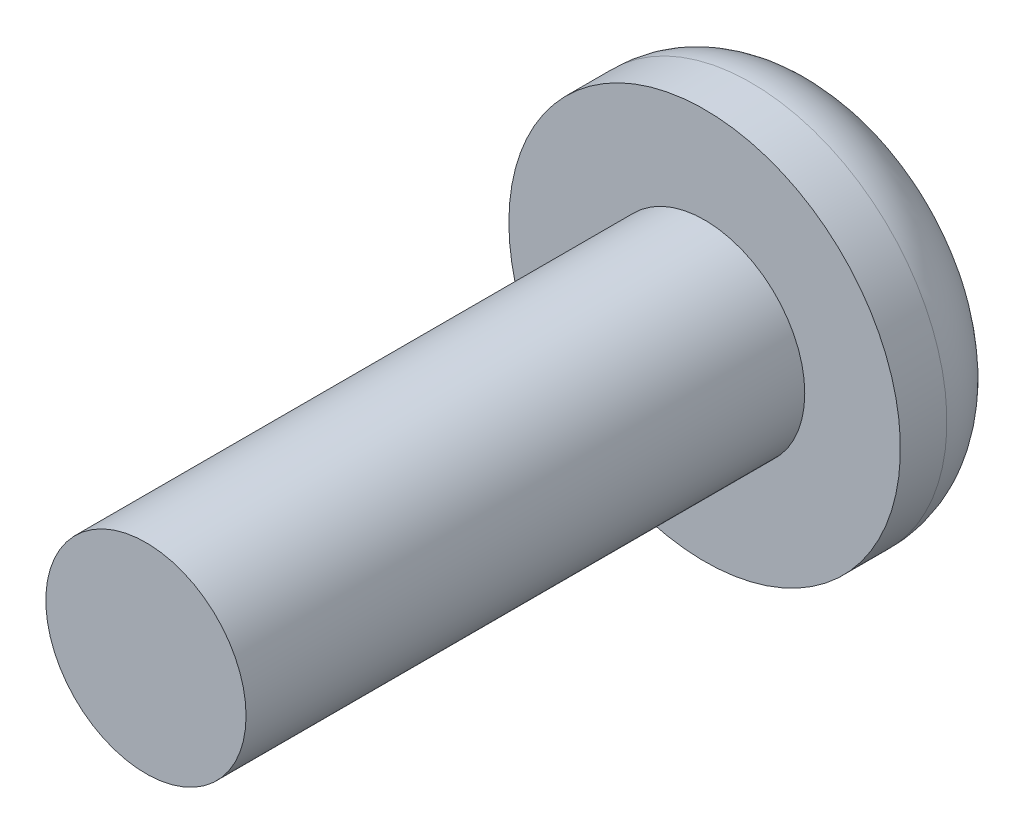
ISO-10303-21;
HEADER;
FILE_DESCRIPTION(('STEP AP214'),'2;1');
FILE_NAME('part.step','',(''),(''),'','','');
FILE_SCHEMA(('AUTOMOTIVE_DESIGN { 1 0 10303 214 1 1 1 1 }'));
ENDSEC;
DATA;
#1=APPLICATION_CONTEXT('core data for automotive mechanical design processes');
#2=APPLICATION_PROTOCOL_DEFINITION('international standard','automotive_design',2000,#1);
#3=PRODUCT_CONTEXT('',#1,'mechanical');
#4=PRODUCT('Part','Part','',(#3));
#5=PRODUCT_RELATED_PRODUCT_CATEGORY('part','',(#4));
#6=PRODUCT_DEFINITION_FORMATION('','',#4);
#7=PRODUCT_DEFINITION_CONTEXT('part definition',#1,'design');
#8=PRODUCT_DEFINITION('design','',#6,#7);
#9=PRODUCT_DEFINITION_SHAPE('','',#8);
#10=(LENGTH_UNIT() NAMED_UNIT(*) SI_UNIT(.MILLI.,.METRE.));
#11=(NAMED_UNIT(*) PLANE_ANGLE_UNIT() SI_UNIT($,.RADIAN.));
#12=(NAMED_UNIT(*) SI_UNIT($,.STERADIAN.) SOLID_ANGLE_UNIT());
#13=UNCERTAINTY_MEASURE_WITH_UNIT(LENGTH_MEASURE(1.E-05),#10,'distance_accuracy_value','');
#14=(GEOMETRIC_REPRESENTATION_CONTEXT(3) GLOBAL_UNCERTAINTY_ASSIGNED_CONTEXT((#13)) GLOBAL_UNIT_ASSIGNED_CONTEXT((#10,
#11,#12)) REPRESENTATION_CONTEXT('',''));
#15=CARTESIAN_POINT('',(0.,0.,0.));
#16=DIRECTION('',(0.,0.,1.));
#17=DIRECTION('',(1.,0.,0.));
#18=AXIS2_PLACEMENT_3D('',#15,#16,#17);
#19=CARTESIAN_POINT('',(0.,0.,-1.7272));
#20=DIRECTION('',(0.,0.,-1.));
#21=DIRECTION('',(-1.,0.,0.));
#22=AXIS2_PLACEMENT_3D('',#19,#20,#21);
#23=PLANE('',#22);
#24=CARTESIAN_POINT('',(0.,0.,-1.7272));
#25=DIRECTION('',(0.,0.,-1.));
#26=DIRECTION('',(-1.,0.,0.));
#27=AXIS2_PLACEMENT_3D('',#24,#25,#26);
#28=CIRCLE('',#27,1.7145);
#29=CARTESIAN_POINT('',(-1.7145,0.,-1.7272));
#30=VERTEX_POINT('',#29);
#31=EDGE_CURVE('E45',#30,#30,#28,.T.);
#32=ORIENTED_EDGE('',*,*,#31,.T.);
#33=EDGE_LOOP('',(#32));
#34=FACE_BOUND('',#33,.T.);
#35=DIRECTION('',(0.,-1.,0.));
#36=VECTOR('',#35,1.);
#37=CARTESIAN_POINT('',(1.4224,0.342899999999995,-1.72719999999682));
#38=LINE('',#37,#36);
#39=CARTESIAN_POINT('',(1.4224,0.342899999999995,-1.72719999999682));
#40=VERTEX_POINT('',#39);
#41=CARTESIAN_POINT('',(1.4224,-0.342900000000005,-1.72719999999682));
#42=VERTEX_POINT('',#41);
#43=EDGE_CURVE('E196',#40,#42,#38,.T.);
#44=ORIENTED_EDGE('',*,*,#43,.F.);
#45=DIRECTION('',(-1.,0.,0.));
#46=VECTOR('',#45,1.);
#47=CARTESIAN_POINT('',(1.4224,0.342899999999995,-1.72719999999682));
#48=LINE('',#47,#46);
#49=CARTESIAN_POINT('',(0.3429,0.342899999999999,-1.72719999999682));
#50=VERTEX_POINT('',#49);
#51=EDGE_CURVE('E190',#40,#50,#48,.T.);
#52=ORIENTED_EDGE('',*,*,#51,.T.);
#53=DIRECTION('',(0.,1.,0.));
#54=VECTOR('',#53,1.);
#55=CARTESIAN_POINT('',(0.3429,0.,-1.72719999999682));
#56=LINE('',#55,#54);
#57=CARTESIAN_POINT('',(0.3429,1.4224,-1.72719999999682));
#58=VERTEX_POINT('',#57);
#59=EDGE_CURVE('E65',#50,#58,#56,.T.);
#60=ORIENTED_EDGE('',*,*,#59,.T.);
#61=DIRECTION('',(1.,0.,0.));
#62=VECTOR('',#61,1.);
#63=CARTESIAN_POINT('',(-0.3429,1.4224,-1.72719999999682));
#64=LINE('',#63,#62);
#65=CARTESIAN_POINT('',(-0.3429,1.4224,-1.72719999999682));
#66=VERTEX_POINT('',#65);
#67=EDGE_CURVE('E217',#66,#58,#64,.T.);
#68=ORIENTED_EDGE('',*,*,#67,.F.);
#69=DIRECTION('',(0.,-1.,0.));
#70=VECTOR('',#69,1.);
#71=CARTESIAN_POINT('',(-0.3429,1.4224,-1.72719999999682));
#72=LINE('',#71,#70);
#73=CARTESIAN_POINT('',(-0.3429,0.342900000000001,-1.72719999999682));
#74=VERTEX_POINT('',#73);
#75=EDGE_CURVE('E211',#66,#74,#72,.T.);
#76=ORIENTED_EDGE('',*,*,#75,.T.);
#77=CARTESIAN_POINT('',(-1.4224,0.342900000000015,-1.72719999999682));
#78=VERTEX_POINT('',#77);
#79=EDGE_CURVE('E199',#74,#78,#48,.T.);
#80=ORIENTED_EDGE('',*,*,#79,.T.);
#81=DIRECTION('',(0.,1.,0.));
#82=VECTOR('',#81,1.);
#83=CARTESIAN_POINT('',(-1.4224,-0.342899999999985,-1.72719999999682));
#84=LINE('',#83,#82);
#85=CARTESIAN_POINT('',(-1.4224,-0.342899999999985,-1.72719999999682));
#86=VERTEX_POINT('',#85);
#87=EDGE_CURVE('E144',#86,#78,#84,.T.);
#88=ORIENTED_EDGE('',*,*,#87,.F.);
#89=DIRECTION('',(1.,0.,0.));
#90=VECTOR('',#89,1.);
#91=CARTESIAN_POINT('',(-1.4224,-0.342899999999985,-1.72719999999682));
#92=LINE('',#91,#90);
#93=CARTESIAN_POINT('',(-0.34290000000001,-0.342899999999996,-1.72719999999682));
#94=VERTEX_POINT('',#93);
#95=EDGE_CURVE('E155',#86,#94,#92,.T.);
#96=ORIENTED_EDGE('',*,*,#95,.T.);
#97=DIRECTION('',(0.,-1.,0.));
#98=VECTOR('',#97,1.);
#99=CARTESIAN_POINT('',(-0.3429,0.,-1.72719999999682));
#100=LINE('',#99,#98);
#101=CARTESIAN_POINT('',(-0.34290000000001,-1.4224,-1.72719999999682));
#102=VERTEX_POINT('',#101);
#103=EDGE_CURVE('E164',#94,#102,#100,.T.);
#104=ORIENTED_EDGE('',*,*,#103,.T.);
#105=DIRECTION('',(-1.,0.,0.));
#106=VECTOR('',#105,1.);
#107=CARTESIAN_POINT('',(0.34289999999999,-1.4224,-1.72719999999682));
#108=LINE('',#107,#106);
#109=CARTESIAN_POINT('',(0.34289999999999,-1.4224,-1.72719999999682));
#110=VERTEX_POINT('',#109);
#111=EDGE_CURVE('E177',#110,#102,#108,.T.);
#112=ORIENTED_EDGE('',*,*,#111,.F.);
#113=DIRECTION('',(0.,1.,0.));
#114=VECTOR('',#113,1.);
#115=CARTESIAN_POINT('',(0.34289999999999,-1.4224,-1.72719999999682));
#116=LINE('',#115,#114);
#117=CARTESIAN_POINT('',(0.342899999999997,-0.342900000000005,-1.72719999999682));
#118=VERTEX_POINT('',#117);
#119=EDGE_CURVE('E168',#110,#118,#116,.T.);
#120=ORIENTED_EDGE('',*,*,#119,.T.);
#121=DIRECTION('',(1.,0.,0.));
#122=VECTOR('',#121,1.);
#123=CARTESIAN_POINT('',(0.,-0.3429,-1.72719999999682));
#124=LINE('',#123,#122);
#125=EDGE_CURVE('E187',#118,#42,#124,.T.);
#126=ORIENTED_EDGE('',*,*,#125,.T.);
#127=EDGE_LOOP('',(#44,#52,#60,#68,#76,#80,#88,#96,#104,#112,#120,#126));
#128=FACE_BOUND('',#127,.T.);
#129=ADVANCED_FACE('F36',(#34,#128),#23,.T.);
#130=CARTESIAN_POINT('',(0.3429,0.,-0.86359999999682));
#131=DIRECTION('',(-1.,0.,0.));
#132=DIRECTION('',(0.,-1.,0.));
#133=AXIS2_PLACEMENT_3D('',#130,#131,#132);
#134=PLANE('',#133);
#135=ORIENTED_EDGE('',*,*,#59,.F.);
#136=DIRECTION('',(0.,0.,1.));
#137=VECTOR('',#136,1.);
#138=CARTESIAN_POINT('',(0.3429,0.342899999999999,-0.86359999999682));
#139=LINE('',#138,#137);
#140=CARTESIAN_POINT('',(0.3429,0.342899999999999,-0.86359999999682));
#141=VERTEX_POINT('',#140);
#142=EDGE_CURVE('E205',#50,#141,#139,.T.);
#143=ORIENTED_EDGE('',*,*,#142,.T.);
#144=DIRECTION('',(0.,1.,0.));
#145=VECTOR('',#144,1.);
#146=CARTESIAN_POINT('',(0.3429,0.,-0.86359999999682));
#147=LINE('',#146,#145);
#148=CARTESIAN_POINT('',(0.3429,1.4224,-0.86359999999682));
#149=VERTEX_POINT('',#148);
#150=EDGE_CURVE('E208',#141,#149,#147,.T.);
#151=ORIENTED_EDGE('',*,*,#150,.T.);
#152=DIRECTION('',(0.,0.,-1.));
#153=VECTOR('',#152,1.);
#154=CARTESIAN_POINT('',(0.3429,1.4224,-0.86359999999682));
#155=LINE('',#154,#153);
#156=EDGE_CURVE('E223',#149,#58,#155,.T.);
#157=ORIENTED_EDGE('',*,*,#156,.T.);
#158=EDGE_LOOP('',(#135,#143,#151,#157));
#159=FACE_BOUND('',#158,.T.);
#160=ADVANCED_FACE('F252',(#159),#134,.T.);
#161=CARTESIAN_POINT('',(-0.3429,1.4224,-0.86359999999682));
#162=DIRECTION('',(1.,0.,0.));
#163=DIRECTION('',(0.,1.,0.));
#164=AXIS2_PLACEMENT_3D('',#161,#162,#163);
#165=PLANE('',#164);
#166=DIRECTION('',(0.,-1.,0.));
#167=VECTOR('',#166,1.);
#168=CARTESIAN_POINT('',(-0.3429,1.4224,-0.86359999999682));
#169=LINE('',#168,#167);
#170=CARTESIAN_POINT('',(-0.3429,1.4224,-0.86359999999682));
#171=VERTEX_POINT('',#170);
#172=CARTESIAN_POINT('',(-0.3429,0.342900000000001,-0.86359999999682));
#173=VERTEX_POINT('',#172);
#174=EDGE_CURVE('E214',#171,#173,#169,.T.);
#175=ORIENTED_EDGE('',*,*,#174,.T.);
#176=DIRECTION('',(0.,0.,-1.));
#177=VECTOR('',#176,1.);
#178=CARTESIAN_POINT('',(-0.3429,0.342900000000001,-0.86359999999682));
#179=LINE('',#178,#177);
#180=EDGE_CURVE('E73',#173,#74,#179,.T.);
#181=ORIENTED_EDGE('',*,*,#180,.T.);
#182=ORIENTED_EDGE('',*,*,#75,.F.);
#183=DIRECTION('',(0.,0.,-1.));
#184=VECTOR('',#183,1.);
#185=CARTESIAN_POINT('',(-0.3429,1.4224,-0.86359999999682));
#186=LINE('',#185,#184);
#187=EDGE_CURVE('E53',#171,#66,#186,.T.);
#188=ORIENTED_EDGE('',*,*,#187,.F.);
#189=EDGE_LOOP('',(#175,#181,#182,#188));
#190=FACE_BOUND('',#189,.T.);
#191=ADVANCED_FACE('F257',(#190),#165,.T.);
#192=CARTESIAN_POINT('',(0.,0.,7.9375));
#193=DIRECTION('',(0.,0.,-1.));
#194=DIRECTION('',(-1.,0.,0.));
#195=AXIS2_PLACEMENT_3D('',#192,#193,#194);
#196=CYLINDRICAL_SURFACE('',#195,1.4224);
#197=CARTESIAN_POINT('',(0.,0.,7.9375));
#198=DIRECTION('',(0.,0.,1.));
#199=DIRECTION('',(1.,0.,0.));
#200=AXIS2_PLACEMENT_3D('',#197,#198,#199);
#201=CIRCLE('',#200,1.4224);
#202=CARTESIAN_POINT('',(1.4224,0.,7.9375));
#203=VERTEX_POINT('',#202);
#204=EDGE_CURVE('E231',#203,#203,#201,.T.);
#205=ORIENTED_EDGE('',*,*,#204,.F.);
#206=EDGE_LOOP('',(#205));
#207=FACE_BOUND('',#206,.T.);
#208=CARTESIAN_POINT('',(0.,0.,0.));
#209=DIRECTION('',(0.,0.,1.));
#210=DIRECTION('',(1.,0.,0.));
#211=AXIS2_PLACEMENT_3D('',#208,#209,#210);
#212=CIRCLE('',#211,1.4224);
#213=CARTESIAN_POINT('',(1.4224,0.,0.));
#214=VERTEX_POINT('',#213);
#215=EDGE_CURVE('E228',#214,#214,#212,.T.);
#216=ORIENTED_EDGE('',*,*,#215,.T.);
#217=EDGE_LOOP('',(#216));
#218=FACE_BOUND('',#217,.T.);
#219=ADVANCED_FACE('F264',(#207,#218),#196,.T.);
#220=CARTESIAN_POINT('',(0.,0.,7.9375));
#221=DIRECTION('',(0.,0.,1.));
#222=DIRECTION('',(1.,0.,0.));
#223=AXIS2_PLACEMENT_3D('',#220,#221,#222);
#224=PLANE('',#223);
#225=ORIENTED_EDGE('',*,*,#204,.T.);
#226=EDGE_LOOP('',(#225));
#227=FACE_BOUND('',#226,.T.);
#228=ADVANCED_FACE('F262',(#227),#224,.T.);
#229=CARTESIAN_POINT('',(2.7813,0.,0.));
#230=DIRECTION('',(0.,0.,1.));
#231=DIRECTION('',(1.,0.,0.));
#232=AXIS2_PLACEMENT_3D('',#229,#230,#231);
#233=PLANE('',#232);
#234=CARTESIAN_POINT('',(0.,0.,0.));
#235=DIRECTION('',(0.,0.,-1.));
#236=DIRECTION('',(-1.,0.,0.));
#237=AXIS2_PLACEMENT_3D('',#234,#235,#236);
#238=CIRCLE('',#237,2.7813);
#239=CARTESIAN_POINT('',(-2.7813,0.,0.));
#240=VERTEX_POINT('',#239);
#241=EDGE_CURVE('E225',#240,#240,#238,.T.);
#242=ORIENTED_EDGE('',*,*,#241,.F.);
#243=EDGE_LOOP('',(#242));
#244=FACE_BOUND('',#243,.T.);
#245=ORIENTED_EDGE('',*,*,#215,.F.);
#246=EDGE_LOOP('',(#245));
#247=FACE_BOUND('',#246,.T.);
#248=ADVANCED_FACE('F247',(#244,#247),#233,.T.);
#249=CARTESIAN_POINT('',(0.,0.,-4.84031750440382));
#250=DIRECTION('',(0.,0.,-1.));
#251=DIRECTION('',(-1.,0.,0.));
#252=AXIS2_PLACEMENT_3D('',#249,#250,#251);
#253=CYLINDRICAL_SURFACE('',#252,2.7813);
#254=CARTESIAN_POINT('',(0.,0.,-0.6604));
#255=DIRECTION('',(0.,0.,-1.));
#256=DIRECTION('',(-1.,0.,0.));
#257=AXIS2_PLACEMENT_3D('',#254,#255,#256);
#258=CIRCLE('',#257,2.7813);
#259=CARTESIAN_POINT('',(-2.7813,0.,-0.6604));
#260=VERTEX_POINT('',#259);
#261=EDGE_CURVE('E11',#260,#260,#258,.F.);
#262=ORIENTED_EDGE('',*,*,#261,.T.);
#263=EDGE_LOOP('',(#262));
#264=FACE_BOUND('',#263,.T.);
#265=ORIENTED_EDGE('',*,*,#241,.T.);
#266=EDGE_LOOP('',(#265));
#267=FACE_BOUND('',#266,.T.);
#268=ADVANCED_FACE('F239',(#264,#267),#253,.T.);
#269=CARTESIAN_POINT('',(0.,0.,-0.6604));
#270=DIRECTION('',(0.,0.,-1.));
#271=DIRECTION('',(-1.,0.,0.));
#272=AXIS2_PLACEMENT_3D('',#269,#270,#271);
#273=TOROIDAL_SURFACE('',#272,1.7145,1.0668);
#274=ORIENTED_EDGE('',*,*,#261,.F.);
#275=EDGE_LOOP('',(#274));
#276=FACE_BOUND('',#275,.T.);
#277=ORIENTED_EDGE('',*,*,#31,.F.);
#278=EDGE_LOOP('',(#277));
#279=FACE_BOUND('',#278,.T.);
#280=ADVANCED_FACE('F38',(#276,#279),#273,.T.);
#281=CARTESIAN_POINT('',(-0.3429,1.4224,-0.86359999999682));
#282=DIRECTION('',(0.,1.,0.));
#283=DIRECTION('',(0.,0.,1.));
#284=AXIS2_PLACEMENT_3D('',#281,#282,#283);
#285=PLANE('',#284);
#286=ORIENTED_EDGE('',*,*,#67,.T.);
#287=ORIENTED_EDGE('',*,*,#156,.F.);
#288=DIRECTION('',(1.,0.,0.));
#289=VECTOR('',#288,1.);
#290=CARTESIAN_POINT('',(-0.3429,1.4224,-0.86359999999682));
#291=LINE('',#290,#289);
#292=EDGE_CURVE('E210',#171,#149,#291,.T.);
#293=ORIENTED_EDGE('',*,*,#292,.F.);
#294=ORIENTED_EDGE('',*,*,#187,.T.);
#295=EDGE_LOOP('',(#286,#287,#293,#294));
#296=FACE_BOUND('',#295,.T.);
#297=ADVANCED_FACE('F238',(#296),#285,.F.);
#298=CARTESIAN_POINT('',(0.3429,0.,-0.86359999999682));
#299=DIRECTION('',(0.,0.,1.));
#300=DIRECTION('',(1.,0.,0.));
#301=AXIS2_PLACEMENT_3D('',#298,#299,#300);
#302=PLANE('',#301);
#303=ORIENTED_EDGE('',*,*,#150,.F.);
#304=DIRECTION('',(-1.,0.,0.));
#305=VECTOR('',#304,1.);
#306=CARTESIAN_POINT('',(1.4224,0.342899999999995,-0.86359999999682));
#307=LINE('',#306,#305);
#308=CARTESIAN_POINT('',(1.4224,0.342899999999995,-0.86359999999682));
#309=VERTEX_POINT('',#308);
#310=EDGE_CURVE('E136',#309,#141,#307,.T.);
#311=ORIENTED_EDGE('',*,*,#310,.F.);
#312=DIRECTION('',(0.,-1.,0.));
#313=VECTOR('',#312,1.);
#314=CARTESIAN_POINT('',(1.4224,0.342899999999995,-0.86359999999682));
#315=LINE('',#314,#313);
#316=CARTESIAN_POINT('',(1.4224,-0.342900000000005,-0.86359999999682));
#317=VERTEX_POINT('',#316);
#318=EDGE_CURVE('E137',#309,#317,#315,.T.);
#319=ORIENTED_EDGE('',*,*,#318,.T.);
#320=DIRECTION('',(1.,0.,0.));
#321=VECTOR('',#320,1.);
#322=CARTESIAN_POINT('',(0.,-0.3429,-0.86359999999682));
#323=LINE('',#322,#321);
#324=CARTESIAN_POINT('',(0.342899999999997,-0.342900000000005,-0.86359999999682));
#325=VERTEX_POINT('',#324);
#326=EDGE_CURVE('E188',#325,#317,#323,.T.);
#327=ORIENTED_EDGE('',*,*,#326,.F.);
#328=DIRECTION('',(0.,1.,0.));
#329=VECTOR('',#328,1.);
#330=CARTESIAN_POINT('',(0.34289999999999,-1.4224,-0.86359999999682));
#331=LINE('',#330,#329);
#332=CARTESIAN_POINT('',(0.34289999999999,-1.4224,-0.86359999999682));
#333=VERTEX_POINT('',#332);
#334=EDGE_CURVE('E171',#333,#325,#331,.T.);
#335=ORIENTED_EDGE('',*,*,#334,.F.);
#336=DIRECTION('',(-1.,0.,0.));
#337=VECTOR('',#336,1.);
#338=CARTESIAN_POINT('',(0.34289999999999,-1.4224,-0.86359999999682));
#339=LINE('',#338,#337);
#340=CARTESIAN_POINT('',(-0.34290000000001,-1.4224,-0.86359999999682));
#341=VERTEX_POINT('',#340);
#342=EDGE_CURVE('E167',#333,#341,#339,.T.);
#343=ORIENTED_EDGE('',*,*,#342,.T.);
#344=DIRECTION('',(0.,-1.,0.));
#345=VECTOR('',#344,1.);
#346=CARTESIAN_POINT('',(-0.3429,0.,-0.86359999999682));
#347=LINE('',#346,#345);
#348=CARTESIAN_POINT('',(-0.34290000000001,-0.342899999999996,-0.86359999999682));
#349=VERTEX_POINT('',#348);
#350=EDGE_CURVE('E165',#349,#341,#347,.T.);
#351=ORIENTED_EDGE('',*,*,#350,.F.);
#352=DIRECTION('',(1.,0.,0.));
#353=VECTOR('',#352,1.);
#354=CARTESIAN_POINT('',(-1.4224,-0.342899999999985,-0.86359999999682));
#355=LINE('',#354,#353);
#356=CARTESIAN_POINT('',(-1.4224,-0.342899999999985,-0.86359999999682));
#357=VERTEX_POINT('',#356);
#358=EDGE_CURVE('E154',#357,#349,#355,.T.);
#359=ORIENTED_EDGE('',*,*,#358,.F.);
#360=DIRECTION('',(0.,1.,0.));
#361=VECTOR('',#360,1.);
#362=CARTESIAN_POINT('',(-1.4224,-0.342899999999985,-0.86359999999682));
#363=LINE('',#362,#361);
#364=CARTESIAN_POINT('',(-1.4224,0.342900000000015,-0.86359999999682));
#365=VERTEX_POINT('',#364);
#366=EDGE_CURVE('E142',#357,#365,#363,.T.);
#367=ORIENTED_EDGE('',*,*,#366,.T.);
#368=EDGE_CURVE('E129',#173,#365,#307,.T.);
#369=ORIENTED_EDGE('',*,*,#368,.F.);
#370=ORIENTED_EDGE('',*,*,#174,.F.);
#371=ORIENTED_EDGE('',*,*,#292,.T.);
#372=EDGE_LOOP('',(#303,#311,#319,#327,#335,#343,#351,#359,#367,#369,#370,#371));
#373=FACE_BOUND('',#372,.T.);
#374=ADVANCED_FACE('F151',(#373),#302,.F.);
#375=CARTESIAN_POINT('',(1.4224,0.342899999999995,-0.86359999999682));
#376=DIRECTION('',(0.,-1.,0.));
#377=DIRECTION('',(1.,0.,0.));
#378=AXIS2_PLACEMENT_3D('',#375,#376,#377);
#379=PLANE('',#378);
#380=ORIENTED_EDGE('',*,*,#51,.F.);
#381=DIRECTION('',(0.,0.,-1.));
#382=VECTOR('',#381,1.);
#383=CARTESIAN_POINT('',(1.4224,0.342899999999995,-0.86359999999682));
#384=LINE('',#383,#382);
#385=EDGE_CURVE('E193',#309,#40,#384,.T.);
#386=ORIENTED_EDGE('',*,*,#385,.F.);
#387=ORIENTED_EDGE('',*,*,#310,.T.);
#388=ORIENTED_EDGE('',*,*,#142,.F.);
#389=EDGE_LOOP('',(#380,#386,#387,#388));
#390=FACE_BOUND('',#389,.T.);
#391=ADVANCED_FACE('F284',(#390),#379,.T.);
#392=CARTESIAN_POINT('',(0.,-0.3429,-0.86359999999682));
#393=DIRECTION('',(0.,1.,0.));
#394=DIRECTION('',(-1.,0.,0.));
#395=AXIS2_PLACEMENT_3D('',#392,#393,#394);
#396=PLANE('',#395);
#397=DIRECTION('',(0.,0.,1.));
#398=VECTOR('',#397,1.);
#399=CARTESIAN_POINT('',(0.342899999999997,-0.342900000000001,-0.86359999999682));
#400=LINE('',#399,#398);
#401=EDGE_CURVE('E185',#118,#325,#400,.T.);
#402=ORIENTED_EDGE('',*,*,#401,.T.);
#403=ORIENTED_EDGE('',*,*,#326,.T.);
#404=DIRECTION('',(0.,0.,-1.));
#405=VECTOR('',#404,1.);
#406=CARTESIAN_POINT('',(1.4224,-0.342900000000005,-0.86359999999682));
#407=LINE('',#406,#405);
#408=EDGE_CURVE('E202',#317,#42,#407,.T.);
#409=ORIENTED_EDGE('',*,*,#408,.T.);
#410=ORIENTED_EDGE('',*,*,#125,.F.);
#411=EDGE_LOOP('',(#402,#403,#409,#410));
#412=FACE_BOUND('',#411,.T.);
#413=ADVANCED_FACE('F285',(#412),#396,.T.);
#414=CARTESIAN_POINT('',(1.4224,0.342899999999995,-0.86359999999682));
#415=DIRECTION('',(1.,0.,0.));
#416=DIRECTION('',(0.,1.,0.));
#417=AXIS2_PLACEMENT_3D('',#414,#415,#416);
#418=PLANE('',#417);
#419=ORIENTED_EDGE('',*,*,#43,.T.);
#420=ORIENTED_EDGE('',*,*,#408,.F.);
#421=ORIENTED_EDGE('',*,*,#318,.F.);
#422=ORIENTED_EDGE('',*,*,#385,.T.);
#423=EDGE_LOOP('',(#419,#420,#421,#422));
#424=FACE_BOUND('',#423,.T.);
#425=ADVANCED_FACE('F288',(#424),#418,.F.);
#426=ORIENTED_EDGE('',*,*,#368,.T.);
#427=DIRECTION('',(0.,0.,-1.));
#428=VECTOR('',#427,1.);
#429=CARTESIAN_POINT('',(-1.4224,0.342900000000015,-0.86359999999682));
#430=LINE('',#429,#428);
#431=EDGE_CURVE('E132',#365,#78,#430,.T.);
#432=ORIENTED_EDGE('',*,*,#431,.T.);
#433=ORIENTED_EDGE('',*,*,#79,.F.);
#434=ORIENTED_EDGE('',*,*,#180,.F.);
#435=EDGE_LOOP('',(#426,#432,#433,#434));
#436=FACE_BOUND('',#435,.T.);
#437=ADVANCED_FACE('F131',(#436),#379,.T.);
#438=CARTESIAN_POINT('',(0.34289999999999,-1.4224,-0.86359999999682));
#439=DIRECTION('',(-1.,0.,0.));
#440=DIRECTION('',(0.,-1.,0.));
#441=AXIS2_PLACEMENT_3D('',#438,#439,#440);
#442=PLANE('',#441);
#443=ORIENTED_EDGE('',*,*,#119,.F.);
#444=DIRECTION('',(0.,0.,-1.));
#445=VECTOR('',#444,1.);
#446=CARTESIAN_POINT('',(0.34289999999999,-1.4224,-0.86359999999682));
#447=LINE('',#446,#445);
#448=EDGE_CURVE('E174',#333,#110,#447,.T.);
#449=ORIENTED_EDGE('',*,*,#448,.F.);
#450=ORIENTED_EDGE('',*,*,#334,.T.);
#451=ORIENTED_EDGE('',*,*,#401,.F.);
#452=EDGE_LOOP('',(#443,#449,#450,#451));
#453=FACE_BOUND('',#452,.T.);
#454=ADVANCED_FACE('F295',(#453),#442,.T.);
#455=CARTESIAN_POINT('',(-0.3429,0.,-0.86359999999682));
#456=DIRECTION('',(1.,0.,0.));
#457=DIRECTION('',(0.,1.,0.));
#458=AXIS2_PLACEMENT_3D('',#455,#456,#457);
#459=PLANE('',#458);
#460=DIRECTION('',(0.,0.,1.));
#461=VECTOR('',#460,1.);
#462=CARTESIAN_POINT('',(-0.342900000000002,-0.342899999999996,-0.86359999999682));
#463=LINE('',#462,#461);
#464=EDGE_CURVE('E146',#94,#349,#463,.T.);
#465=ORIENTED_EDGE('',*,*,#464,.T.);
#466=ORIENTED_EDGE('',*,*,#350,.T.);
#467=DIRECTION('',(0.,0.,-1.));
#468=VECTOR('',#467,1.);
#469=CARTESIAN_POINT('',(-0.34290000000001,-1.4224,-0.86359999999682));
#470=LINE('',#469,#468);
#471=EDGE_CURVE('E183',#341,#102,#470,.T.);
#472=ORIENTED_EDGE('',*,*,#471,.T.);
#473=ORIENTED_EDGE('',*,*,#103,.F.);
#474=EDGE_LOOP('',(#465,#466,#472,#473));
#475=FACE_BOUND('',#474,.T.);
#476=ADVANCED_FACE('F296',(#475),#459,.T.);
#477=CARTESIAN_POINT('',(0.34289999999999,-1.4224,-0.86359999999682));
#478=DIRECTION('',(0.,-1.,0.));
#479=DIRECTION('',(1.,0.,0.));
#480=AXIS2_PLACEMENT_3D('',#477,#478,#479);
#481=PLANE('',#480);
#482=ORIENTED_EDGE('',*,*,#111,.T.);
#483=ORIENTED_EDGE('',*,*,#471,.F.);
#484=ORIENTED_EDGE('',*,*,#342,.F.);
#485=ORIENTED_EDGE('',*,*,#448,.T.);
#486=EDGE_LOOP('',(#482,#483,#484,#485));
#487=FACE_BOUND('',#486,.T.);
#488=ADVANCED_FACE('F299',(#487),#481,.F.);
#489=CARTESIAN_POINT('',(-1.4224,-0.342899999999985,-0.86359999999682));
#490=DIRECTION('',(0.,1.,0.));
#491=DIRECTION('',(-1.,0.,0.));
#492=AXIS2_PLACEMENT_3D('',#489,#490,#491);
#493=PLANE('',#492);
#494=ORIENTED_EDGE('',*,*,#95,.F.);
#495=DIRECTION('',(0.,0.,-1.));
#496=VECTOR('',#495,1.);
#497=CARTESIAN_POINT('',(-1.4224,-0.342899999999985,-0.86359999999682));
#498=LINE('',#497,#496);
#499=EDGE_CURVE('E147',#357,#86,#498,.T.);
#500=ORIENTED_EDGE('',*,*,#499,.F.);
#501=ORIENTED_EDGE('',*,*,#358,.T.);
#502=ORIENTED_EDGE('',*,*,#464,.F.);
#503=EDGE_LOOP('',(#494,#500,#501,#502));
#504=FACE_BOUND('',#503,.T.);
#505=ADVANCED_FACE('F303',(#504),#493,.T.);
#506=CARTESIAN_POINT('',(-1.4224,-0.342899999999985,-0.86359999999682));
#507=DIRECTION('',(-1.,0.,0.));
#508=DIRECTION('',(0.,-1.,0.));
#509=AXIS2_PLACEMENT_3D('',#506,#507,#508);
#510=PLANE('',#509);
#511=ORIENTED_EDGE('',*,*,#87,.T.);
#512=ORIENTED_EDGE('',*,*,#431,.F.);
#513=ORIENTED_EDGE('',*,*,#366,.F.);
#514=ORIENTED_EDGE('',*,*,#499,.T.);
#515=EDGE_LOOP('',(#511,#512,#513,#514));
#516=FACE_BOUND('',#515,.T.);
#517=ADVANCED_FACE('F141',(#516),#510,.F.);
#518=CLOSED_SHELL('',(#129,#160,#191,#219,#228,#248,#268,#280,#297,#374,#391,#413,#425,#437,
#454,#476,#488,#505,#517));
#519=MANIFOLD_SOLID_BREP('B2',#518);
#520=ADVANCED_BREP_SHAPE_REPRESENTATION('',(#18,#519),#14);
#521=SHAPE_DEFINITION_REPRESENTATION(#9,#520);
ENDSEC;
END-ISO-10303-21;
